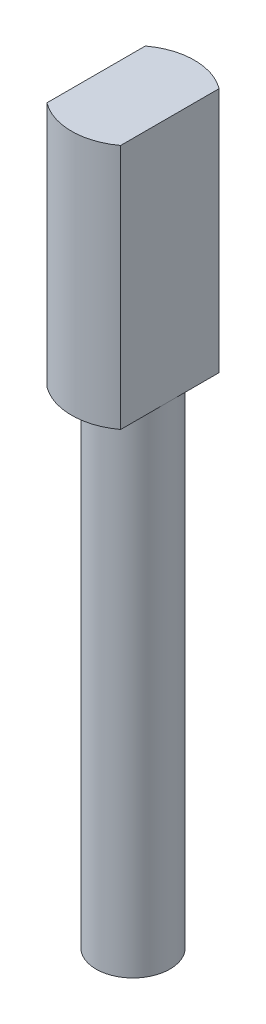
ISO-10303-21;
HEADER;
FILE_DESCRIPTION(('STEP AP214'),'2;1');
FILE_NAME('part.step','',(''),(''),'','','');
FILE_SCHEMA(('AUTOMOTIVE_DESIGN { 1 0 10303 214 1 1 1 1 }'));
ENDSEC;
DATA;
#1=APPLICATION_CONTEXT('core data for automotive mechanical design processes');
#2=APPLICATION_PROTOCOL_DEFINITION('international standard','automotive_design',2000,#1);
#3=PRODUCT_CONTEXT('',#1,'mechanical');
#4=PRODUCT('Part','Part','',(#3));
#5=PRODUCT_RELATED_PRODUCT_CATEGORY('part','',(#4));
#6=PRODUCT_DEFINITION_FORMATION('','',#4);
#7=PRODUCT_DEFINITION_CONTEXT('part definition',#1,'design');
#8=PRODUCT_DEFINITION('design','',#6,#7);
#9=PRODUCT_DEFINITION_SHAPE('','',#8);
#10=(LENGTH_UNIT() NAMED_UNIT(*) SI_UNIT(.MILLI.,.METRE.));
#11=(NAMED_UNIT(*) PLANE_ANGLE_UNIT() SI_UNIT($,.RADIAN.));
#12=(NAMED_UNIT(*) SI_UNIT($,.STERADIAN.) SOLID_ANGLE_UNIT());
#13=UNCERTAINTY_MEASURE_WITH_UNIT(LENGTH_MEASURE(1.E-05),#10,'distance_accuracy_value','');
#14=(GEOMETRIC_REPRESENTATION_CONTEXT(3) GLOBAL_UNCERTAINTY_ASSIGNED_CONTEXT((#13)) GLOBAL_UNIT_ASSIGNED_CONTEXT((#10,
#11,#12)) REPRESENTATION_CONTEXT('',''));
#15=CARTESIAN_POINT('',(0.,0.,0.));
#16=DIRECTION('',(0.,0.,1.));
#17=DIRECTION('',(1.,0.,0.));
#18=AXIS2_PLACEMENT_3D('',#15,#16,#17);
#19=CARTESIAN_POINT('',(0.,40.,0.));
#20=DIRECTION('',(0.,1.,0.));
#21=DIRECTION('',(0.,0.,1.));
#22=AXIS2_PLACEMENT_3D('',#19,#20,#21);
#23=PLANE('',#22);
#24=CARTESIAN_POINT('',(0.,40.,0.));
#25=DIRECTION('',(0.,1.,0.));
#26=DIRECTION('',(0.,0.,1.));
#27=AXIS2_PLACEMENT_3D('',#24,#25,#26);
#28=CIRCLE('',#27,5.);
#29=CARTESIAN_POINT('',(3.,40.,-4.));
#30=VERTEX_POINT('',#29);
#31=CARTESIAN_POINT('',(-3.,40.,-4.));
#32=VERTEX_POINT('',#31);
#33=EDGE_CURVE('E93',#30,#32,#28,.T.);
#34=ORIENTED_EDGE('',*,*,#33,.F.);
#35=DIRECTION('',(0.,0.,1.));
#36=VECTOR('',#35,1.);
#37=CARTESIAN_POINT('',(3.,40.,-5.));
#38=LINE('',#37,#36);
#39=CARTESIAN_POINT('',(3.,40.,0.));
#40=VERTEX_POINT('',#39);
#41=EDGE_CURVE('E125',#30,#40,#38,.T.);
#42=ORIENTED_EDGE('',*,*,#41,.T.);
#43=CARTESIAN_POINT('',(0.,40.,0.));
#44=DIRECTION('',(0.,1.,0.));
#45=DIRECTION('',(0.,0.,1.));
#46=AXIS2_PLACEMENT_3D('',#43,#44,#45);
#47=CIRCLE('',#46,3.);
#48=CARTESIAN_POINT('',(-3.,40.,0.));
#49=VERTEX_POINT('',#48);
#50=EDGE_CURVE('E109',#40,#49,#47,.T.);
#51=ORIENTED_EDGE('',*,*,#50,.T.);
#52=DIRECTION('',(0.,0.,-1.));
#53=VECTOR('',#52,1.);
#54=CARTESIAN_POINT('',(-3.,40.,-5.));
#55=LINE('',#54,#53);
#56=EDGE_CURVE('E90',#49,#32,#55,.T.);
#57=ORIENTED_EDGE('',*,*,#56,.T.);
#58=EDGE_LOOP('',(#34,#42,#51,#57));
#59=FACE_BOUND('',#58,.T.);
#60=ADVANCED_FACE('F32',(#59),#23,.F.);
#61=CARTESIAN_POINT('',(0.,40.,0.));
#62=DIRECTION('',(0.,1.,0.));
#63=DIRECTION('',(0.,0.,1.));
#64=AXIS2_PLACEMENT_3D('',#61,#62,#63);
#65=CYLINDRICAL_SURFACE('',#64,5.);
#66=DIRECTION('',(0.,1.,0.));
#67=VECTOR('',#66,1.);
#68=CARTESIAN_POINT('',(3.,40.,4.));
#69=LINE('',#68,#67);
#70=CARTESIAN_POINT('',(3.,60.,4.));
#71=VERTEX_POINT('',#70);
#72=CARTESIAN_POINT('',(3.,40.,4.));
#73=VERTEX_POINT('',#72);
#74=EDGE_CURVE('E78',#71,#73,#69,.F.);
#75=ORIENTED_EDGE('',*,*,#74,.F.);
#76=CARTESIAN_POINT('',(0.,60.,0.));
#77=DIRECTION('',(0.,1.,0.));
#78=DIRECTION('',(0.,0.,1.));
#79=AXIS2_PLACEMENT_3D('',#76,#77,#78);
#80=CIRCLE('',#79,5.);
#81=CARTESIAN_POINT('',(-3.,60.,4.));
#82=VERTEX_POINT('',#81);
#83=EDGE_CURVE('E87',#82,#71,#80,.T.);
#84=ORIENTED_EDGE('',*,*,#83,.F.);
#85=DIRECTION('',(0.,1.,0.));
#86=VECTOR('',#85,1.);
#87=CARTESIAN_POINT('',(-3.,40.,4.));
#88=LINE('',#87,#86);
#89=CARTESIAN_POINT('',(-3.,40.,4.));
#90=VERTEX_POINT('',#89);
#91=EDGE_CURVE('E54',#90,#82,#88,.T.);
#92=ORIENTED_EDGE('',*,*,#91,.F.);
#93=EDGE_CURVE('E89',#90,#73,#28,.T.);
#94=ORIENTED_EDGE('',*,*,#93,.T.);
#95=EDGE_LOOP('',(#75,#84,#92,#94));
#96=FACE_BOUND('',#95,.T.);
#97=ADVANCED_FACE('F86',(#96),#65,.T.);
#98=CARTESIAN_POINT('',(0.,60.,0.));
#99=DIRECTION('',(0.,-1.,0.));
#100=DIRECTION('',(0.,0.,-1.));
#101=AXIS2_PLACEMENT_3D('',#98,#99,#100);
#102=CYLINDRICAL_SURFACE('',#101,3.);
#103=CARTESIAN_POINT('',(0.,0.,0.));
#104=DIRECTION('',(0.,1.,0.));
#105=DIRECTION('',(0.,0.,1.));
#106=AXIS2_PLACEMENT_3D('',#103,#104,#105);
#107=CIRCLE('',#106,3.);
#108=CARTESIAN_POINT('',(0.,0.,3.));
#109=VERTEX_POINT('',#108);
#110=EDGE_CURVE('E103',#109,#109,#107,.T.);
#111=ORIENTED_EDGE('',*,*,#110,.T.);
#112=EDGE_LOOP('',(#111));
#113=FACE_BOUND('',#112,.T.);
#114=EDGE_CURVE('E110',#49,#40,#47,.T.);
#115=ORIENTED_EDGE('',*,*,#114,.F.);
#116=ORIENTED_EDGE('',*,*,#50,.F.);
#117=EDGE_LOOP('',(#115,#116));
#118=FACE_BOUND('',#117,.T.);
#119=ADVANCED_FACE('F34',(#113,#118),#102,.T.);
#120=CARTESIAN_POINT('',(0.,0.,0.));
#121=DIRECTION('',(0.,1.,0.));
#122=DIRECTION('',(0.,0.,1.));
#123=AXIS2_PLACEMENT_3D('',#120,#121,#122);
#124=PLANE('',#123);
#125=CARTESIAN_POINT('',(0.,0.,0.));
#126=DIRECTION('',(0.,-1.,0.));
#127=DIRECTION('',(0.,0.,-1.));
#128=AXIS2_PLACEMENT_3D('',#125,#126,#127);
#129=CIRCLE('',#128,1.5);
#130=CARTESIAN_POINT('',(0.,0.,-1.5));
#131=VERTEX_POINT('',#130);
#132=EDGE_CURVE('E104',#131,#131,#129,.T.);
#133=ORIENTED_EDGE('',*,*,#132,.F.);
#134=EDGE_LOOP('',(#133));
#135=FACE_BOUND('',#134,.T.);
#136=ORIENTED_EDGE('',*,*,#110,.F.);
#137=EDGE_LOOP('',(#136));
#138=FACE_BOUND('',#137,.T.);
#139=ADVANCED_FACE('F154',(#135,#138),#124,.F.);
#140=CARTESIAN_POINT('',(0.,4.5,0.));
#141=DIRECTION('',(0.,-1.,0.));
#142=DIRECTION('',(0.,0.,-1.));
#143=AXIS2_PLACEMENT_3D('',#140,#141,#142);
#144=CYLINDRICAL_SURFACE('',#143,1.5);
#145=CARTESIAN_POINT('',(0.,4.5,0.));
#146=DIRECTION('',(0.,-1.,0.));
#147=DIRECTION('',(0.,0.,-1.));
#148=AXIS2_PLACEMENT_3D('',#145,#146,#147);
#149=CIRCLE('',#148,1.5);
#150=CARTESIAN_POINT('',(0.,4.5,-1.5));
#151=VERTEX_POINT('',#150);
#152=EDGE_CURVE('E100',#151,#151,#149,.T.);
#153=ORIENTED_EDGE('',*,*,#152,.F.);
#154=EDGE_LOOP('',(#153));
#155=FACE_BOUND('',#154,.T.);
#156=ORIENTED_EDGE('',*,*,#132,.T.);
#157=EDGE_LOOP('',(#156));
#158=FACE_BOUND('',#157,.T.);
#159=ADVANCED_FACE('F143',(#155,#158),#144,.F.);
#160=CARTESIAN_POINT('',(0.,4.5,0.));
#161=DIRECTION('',(0.,-1.,0.));
#162=DIRECTION('',(0.,0.,-1.));
#163=AXIS2_PLACEMENT_3D('',#160,#161,#162);
#164=PLANE('',#163);
#165=ORIENTED_EDGE('',*,*,#152,.T.);
#166=EDGE_LOOP('',(#165));
#167=FACE_BOUND('',#166,.T.);
#168=ADVANCED_FACE('F136',(#167),#164,.T.);
#169=ORIENTED_EDGE('',*,*,#114,.T.);
#170=EDGE_CURVE('E126',#40,#73,#38,.T.);
#171=ORIENTED_EDGE('',*,*,#170,.T.);
#172=ORIENTED_EDGE('',*,*,#93,.F.);
#173=EDGE_CURVE('E120',#90,#49,#55,.T.);
#174=ORIENTED_EDGE('',*,*,#173,.T.);
#175=EDGE_LOOP('',(#169,#171,#172,#174));
#176=FACE_BOUND('',#175,.T.);
#177=ADVANCED_FACE('F134',(#176),#23,.F.);
#178=DIRECTION('',(0.,1.,0.));
#179=VECTOR('',#178,1.);
#180=CARTESIAN_POINT('',(3.,40.,-4.));
#181=LINE('',#180,#179);
#182=CARTESIAN_POINT('',(3.,60.,-4.));
#183=VERTEX_POINT('',#182);
#184=EDGE_CURVE('E46',#30,#183,#181,.T.);
#185=ORIENTED_EDGE('',*,*,#184,.F.);
#186=ORIENTED_EDGE('',*,*,#33,.T.);
#187=DIRECTION('',(0.,1.,0.));
#188=VECTOR('',#187,1.);
#189=CARTESIAN_POINT('',(-3.,40.,-4.));
#190=LINE('',#189,#188);
#191=CARTESIAN_POINT('',(-3.,60.,-4.));
#192=VERTEX_POINT('',#191);
#193=EDGE_CURVE('E97',#192,#32,#190,.F.);
#194=ORIENTED_EDGE('',*,*,#193,.F.);
#195=EDGE_CURVE('E94',#183,#192,#80,.T.);
#196=ORIENTED_EDGE('',*,*,#195,.F.);
#197=EDGE_LOOP('',(#185,#186,#194,#196));
#198=FACE_BOUND('',#197,.T.);
#199=ADVANCED_FACE('F118',(#198),#65,.T.);
#200=CARTESIAN_POINT('',(0.,60.,0.));
#201=DIRECTION('',(0.,1.,0.));
#202=DIRECTION('',(0.,0.,1.));
#203=AXIS2_PLACEMENT_3D('',#200,#201,#202);
#204=PLANE('',#203);
#205=DIRECTION('',(0.,0.,1.));
#206=VECTOR('',#205,1.);
#207=CARTESIAN_POINT('',(3.,60.,0.));
#208=LINE('',#207,#206);
#209=EDGE_CURVE('E11',#183,#71,#208,.T.);
#210=ORIENTED_EDGE('',*,*,#209,.F.);
#211=ORIENTED_EDGE('',*,*,#195,.T.);
#212=DIRECTION('',(0.,0.,-1.));
#213=VECTOR('',#212,1.);
#214=CARTESIAN_POINT('',(-3.,60.,0.));
#215=LINE('',#214,#213);
#216=EDGE_CURVE('E40',#82,#192,#215,.T.);
#217=ORIENTED_EDGE('',*,*,#216,.F.);
#218=ORIENTED_EDGE('',*,*,#83,.T.);
#219=EDGE_LOOP('',(#210,#211,#217,#218));
#220=FACE_BOUND('',#219,.T.);
#221=ADVANCED_FACE('F92',(#220),#204,.T.);
#222=CARTESIAN_POINT('',(-3.,40.,-5.));
#223=DIRECTION('',(1.,0.,0.));
#224=DIRECTION('',(0.,0.,-1.));
#225=AXIS2_PLACEMENT_3D('',#222,#223,#224);
#226=PLANE('',#225);
#227=ORIENTED_EDGE('',*,*,#193,.T.);
#228=ORIENTED_EDGE('',*,*,#56,.F.);
#229=ORIENTED_EDGE('',*,*,#173,.F.);
#230=ORIENTED_EDGE('',*,*,#91,.T.);
#231=ORIENTED_EDGE('',*,*,#216,.T.);
#232=EDGE_LOOP('',(#227,#228,#229,#230,#231));
#233=FACE_BOUND('',#232,.T.);
#234=ADVANCED_FACE('F114',(#233),#226,.F.);
#235=CARTESIAN_POINT('',(3.,40.,-5.));
#236=DIRECTION('',(-1.,0.,0.));
#237=DIRECTION('',(0.,0.,1.));
#238=AXIS2_PLACEMENT_3D('',#235,#236,#237);
#239=PLANE('',#238);
#240=ORIENTED_EDGE('',*,*,#74,.T.);
#241=ORIENTED_EDGE('',*,*,#170,.F.);
#242=ORIENTED_EDGE('',*,*,#41,.F.);
#243=ORIENTED_EDGE('',*,*,#184,.T.);
#244=ORIENTED_EDGE('',*,*,#209,.T.);
#245=EDGE_LOOP('',(#240,#241,#242,#243,#244));
#246=FACE_BOUND('',#245,.T.);
#247=ADVANCED_FACE('F77',(#246),#239,.F.);
#248=CLOSED_SHELL('',(#60,#97,#119,#139,#159,#168,#177,#199,#221,#234,#247));
#249=MANIFOLD_SOLID_BREP('B2',#248);
#250=ADVANCED_BREP_SHAPE_REPRESENTATION('',(#18,#249),#14);
#251=SHAPE_DEFINITION_REPRESENTATION(#9,#250);
ENDSEC;
END-ISO-10303-21;
